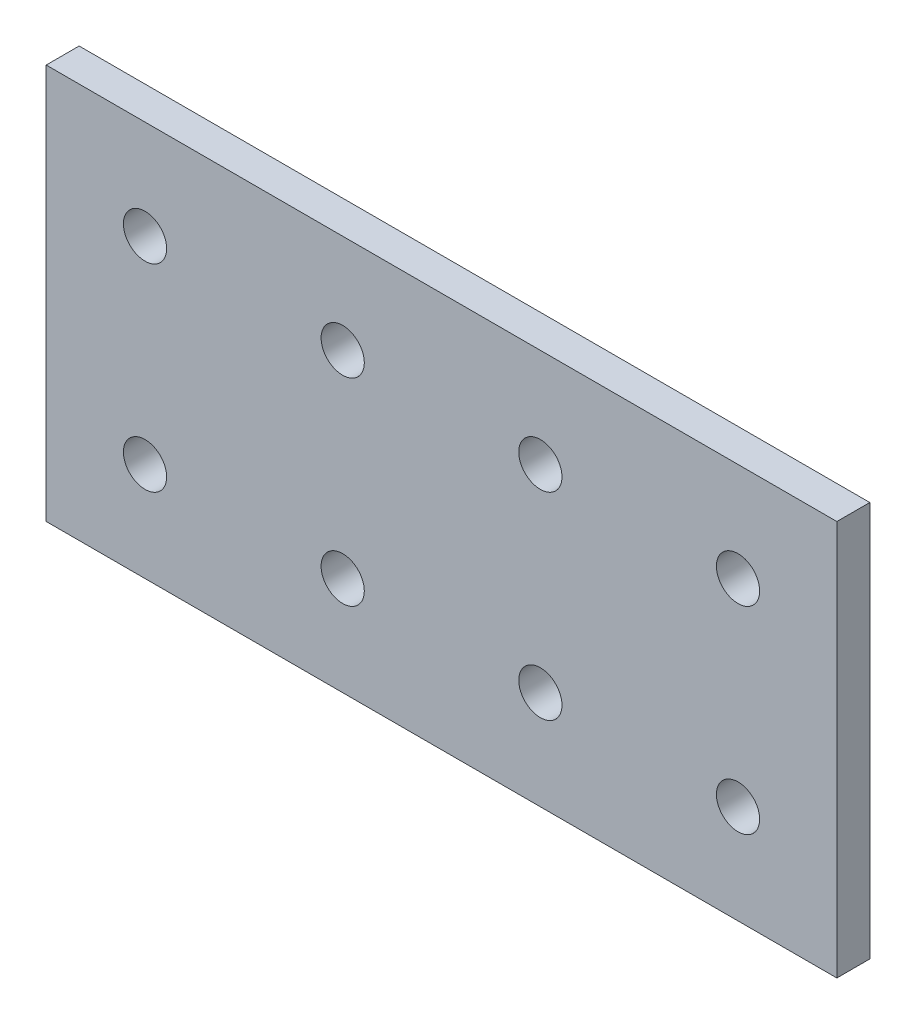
from build123d import *

# Parameters (mm, degrees)
SKETCH1_W      = 152.4
SKETCH1_H      = 76.2
SKETCH1_R      = 4.1656
EXTRUDE1_DEPTH = 6.35


with BuildPart() as part:
    # Sketch1 → Extrude1 (new body)
    with BuildSketch(Plane.XY):
        with Locations((76.2, 38.1)):
            Rectangle(SKETCH1_W, SKETCH1_H)
        with Locations((19.05, 19.05)):
            Circle(SKETCH1_R, mode=Mode.SUBTRACT)
        with Locations((19.05, 57.15)):
            Circle(SKETCH1_R, mode=Mode.SUBTRACT)
        with Locations((57.15, 19.05)):
            Circle(SKETCH1_R, mode=Mode.SUBTRACT)
        with Locations((57.15, 57.15)):
            Circle(SKETCH1_R, mode=Mode.SUBTRACT)
        with Locations((95.25, 19.05)):
            Circle(SKETCH1_R, mode=Mode.SUBTRACT)
        with Locations((95.25, 57.15)):
            Circle(SKETCH1_R, mode=Mode.SUBTRACT)
        with Locations((133.35, 19.05)):
            Circle(SKETCH1_R, mode=Mode.SUBTRACT)
        with Locations((133.35, 57.15)):
            Circle(SKETCH1_R, mode=Mode.SUBTRACT)
    extrude(amount=EXTRUDE1_DEPTH)


solid = part.part
